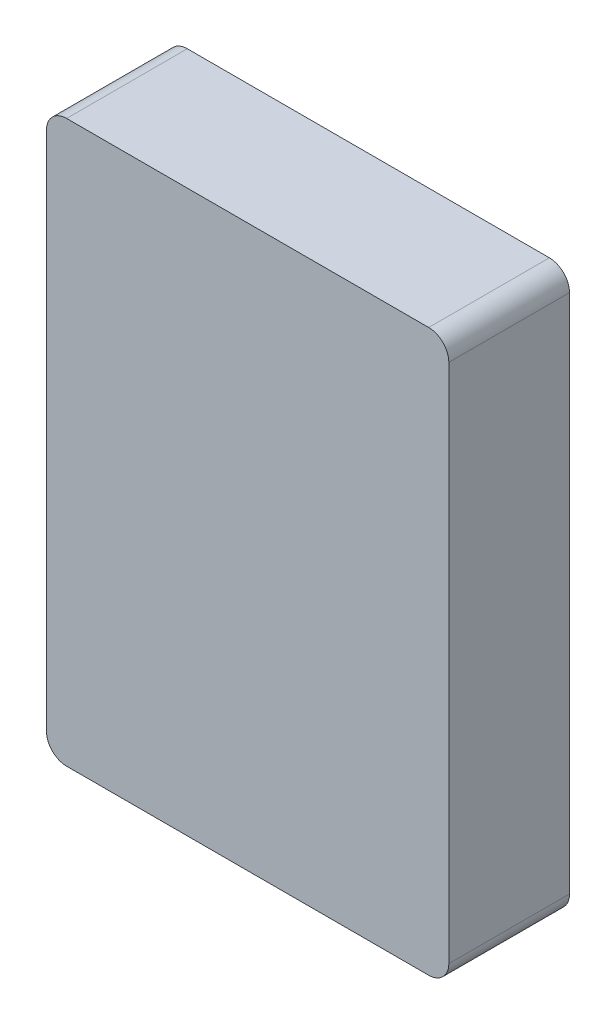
ISO-10303-21;
HEADER;
FILE_DESCRIPTION(('STEP AP214'),'2;1');
FILE_NAME('part.step','',(''),(''),'','','');
FILE_SCHEMA(('AUTOMOTIVE_DESIGN { 1 0 10303 214 1 1 1 1 }'));
ENDSEC;
DATA;
#1=APPLICATION_CONTEXT('core data for automotive mechanical design processes');
#2=APPLICATION_PROTOCOL_DEFINITION('international standard','automotive_design',2000,#1);
#3=PRODUCT_CONTEXT('',#1,'mechanical');
#4=PRODUCT('Part','Part','',(#3));
#5=PRODUCT_RELATED_PRODUCT_CATEGORY('part','',(#4));
#6=PRODUCT_DEFINITION_FORMATION('','',#4);
#7=PRODUCT_DEFINITION_CONTEXT('part definition',#1,'design');
#8=PRODUCT_DEFINITION('design','',#6,#7);
#9=PRODUCT_DEFINITION_SHAPE('','',#8);
#10=(LENGTH_UNIT() NAMED_UNIT(*) SI_UNIT(.MILLI.,.METRE.));
#11=(NAMED_UNIT(*) PLANE_ANGLE_UNIT() SI_UNIT($,.RADIAN.));
#12=(NAMED_UNIT(*) SI_UNIT($,.STERADIAN.) SOLID_ANGLE_UNIT());
#13=UNCERTAINTY_MEASURE_WITH_UNIT(LENGTH_MEASURE(1.E-05),#10,'distance_accuracy_value','');
#14=(GEOMETRIC_REPRESENTATION_CONTEXT(3) GLOBAL_UNCERTAINTY_ASSIGNED_CONTEXT((#13)) GLOBAL_UNIT_ASSIGNED_CONTEXT((#10,
#11,#12)) REPRESENTATION_CONTEXT('',''));
#15=CARTESIAN_POINT('',(0.,0.,0.));
#16=DIRECTION('',(0.,0.,1.));
#17=DIRECTION('',(1.,0.,0.));
#18=AXIS2_PLACEMENT_3D('',#15,#16,#17);
#19=CARTESIAN_POINT('',(0.,0.,60.));
#20=DIRECTION('',(1.,0.,0.));
#21=DIRECTION('',(0.,1.,0.));
#22=AXIS2_PLACEMENT_3D('',#19,#20,#21);
#23=PLANE('',#22);
#24=DIRECTION('',(0.,-1.,0.));
#25=VECTOR('',#24,1.);
#26=CARTESIAN_POINT('',(0.,0.,0.));
#27=LINE('',#26,#25);
#28=CARTESIAN_POINT('',(0.,-10.,0.));
#29=VERTEX_POINT('',#28);
#30=CARTESIAN_POINT('',(0.,-268.88,0.));
#31=VERTEX_POINT('',#30);
#32=EDGE_CURVE('E135',#29,#31,#27,.T.);
#33=ORIENTED_EDGE('',*,*,#32,.T.);
#34=DIRECTION('',(0.,0.,-1.));
#35=VECTOR('',#34,1.);
#36=CARTESIAN_POINT('',(0.,-268.88,60.));
#37=LINE('',#36,#35);
#38=CARTESIAN_POINT('',(0.,-268.88,60.));
#39=VERTEX_POINT('',#38);
#40=EDGE_CURVE('E110',#31,#39,#37,.F.);
#41=ORIENTED_EDGE('',*,*,#40,.T.);
#42=DIRECTION('',(0.,-1.,0.));
#43=VECTOR('',#42,1.);
#44=CARTESIAN_POINT('',(0.,0.,60.));
#45=LINE('',#44,#43);
#46=CARTESIAN_POINT('',(0.,-10.,60.));
#47=VERTEX_POINT('',#46);
#48=EDGE_CURVE('E147',#47,#39,#45,.T.);
#49=ORIENTED_EDGE('',*,*,#48,.F.);
#50=DIRECTION('',(0.,0.,-1.));
#51=VECTOR('',#50,1.);
#52=CARTESIAN_POINT('',(0.,-10.,60.));
#53=LINE('',#52,#51);
#54=EDGE_CURVE('E116',#47,#29,#53,.T.);
#55=ORIENTED_EDGE('',*,*,#54,.T.);
#56=EDGE_LOOP('',(#33,#41,#49,#55));
#57=FACE_BOUND('',#56,.T.);
#58=ADVANCED_FACE('F39',(#57),#23,.F.);
#59=CARTESIAN_POINT('',(0.,-278.88,60.));
#60=DIRECTION('',(0.,1.,0.));
#61=DIRECTION('',(0.,0.,1.));
#62=AXIS2_PLACEMENT_3D('',#59,#60,#61);
#63=PLANE('',#62);
#64=DIRECTION('',(1.,0.,0.));
#65=VECTOR('',#64,1.);
#66=CARTESIAN_POINT('',(0.,-278.88,60.));
#67=LINE('',#66,#65);
#68=CARTESIAN_POINT('',(10.,-278.88,60.));
#69=VERTEX_POINT('',#68);
#70=CARTESIAN_POINT('',(190.,-278.88,60.));
#71=VERTEX_POINT('',#70);
#72=EDGE_CURVE('E126',#69,#71,#67,.T.);
#73=ORIENTED_EDGE('',*,*,#72,.F.);
#74=DIRECTION('',(0.,0.,-1.));
#75=VECTOR('',#74,1.);
#76=CARTESIAN_POINT('',(10.,-278.88,60.));
#77=LINE('',#76,#75);
#78=CARTESIAN_POINT('',(10.,-278.88,0.));
#79=VERTEX_POINT('',#78);
#80=EDGE_CURVE('E109',#69,#79,#77,.T.);
#81=ORIENTED_EDGE('',*,*,#80,.T.);
#82=DIRECTION('',(1.,0.,0.));
#83=VECTOR('',#82,1.);
#84=CARTESIAN_POINT('',(0.,-278.88,0.));
#85=LINE('',#84,#83);
#86=CARTESIAN_POINT('',(190.,-278.88,0.));
#87=VERTEX_POINT('',#86);
#88=EDGE_CURVE('E123',#79,#87,#85,.T.);
#89=ORIENTED_EDGE('',*,*,#88,.T.);
#90=DIRECTION('',(0.,0.,-1.));
#91=VECTOR('',#90,1.);
#92=CARTESIAN_POINT('',(190.,-278.88,60.));
#93=LINE('',#92,#91);
#94=EDGE_CURVE('E129',#87,#71,#93,.F.);
#95=ORIENTED_EDGE('',*,*,#94,.T.);
#96=EDGE_LOOP('',(#73,#81,#89,#95));
#97=FACE_BOUND('',#96,.T.);
#98=ADVANCED_FACE('F122',(#97),#63,.F.);
#99=CARTESIAN_POINT('',(200.,0.,60.));
#100=DIRECTION('',(-1.,0.,0.));
#101=DIRECTION('',(0.,-1.,0.));
#102=AXIS2_PLACEMENT_3D('',#99,#100,#101);
#103=PLANE('',#102);
#104=DIRECTION('',(0.,1.,0.));
#105=VECTOR('',#104,1.);
#106=CARTESIAN_POINT('',(200.,0.,60.));
#107=LINE('',#106,#105);
#108=CARTESIAN_POINT('',(200.,-268.88,60.));
#109=VERTEX_POINT('',#108);
#110=CARTESIAN_POINT('',(200.,-10.,60.));
#111=VERTEX_POINT('',#110);
#112=EDGE_CURVE('E196',#109,#111,#107,.T.);
#113=ORIENTED_EDGE('',*,*,#112,.F.);
#114=DIRECTION('',(0.,0.,-1.));
#115=VECTOR('',#114,1.);
#116=CARTESIAN_POINT('',(200.,-268.88,60.));
#117=LINE('',#116,#115);
#118=CARTESIAN_POINT('',(200.,-268.88,0.));
#119=VERTEX_POINT('',#118);
#120=EDGE_CURVE('E177',#109,#119,#117,.T.);
#121=ORIENTED_EDGE('',*,*,#120,.T.);
#122=DIRECTION('',(0.,1.,0.));
#123=VECTOR('',#122,1.);
#124=CARTESIAN_POINT('',(200.,0.,0.));
#125=LINE('',#124,#123);
#126=CARTESIAN_POINT('',(200.,-10.,0.));
#127=VERTEX_POINT('',#126);
#128=EDGE_CURVE('E134',#119,#127,#125,.T.);
#129=ORIENTED_EDGE('',*,*,#128,.T.);
#130=DIRECTION('',(0.,0.,-1.));
#131=VECTOR('',#130,1.);
#132=CARTESIAN_POINT('',(200.,-10.,60.));
#133=LINE('',#132,#131);
#134=EDGE_CURVE('E174',#127,#111,#133,.F.);
#135=ORIENTED_EDGE('',*,*,#134,.T.);
#136=EDGE_LOOP('',(#113,#121,#129,#135));
#137=FACE_BOUND('',#136,.T.);
#138=ADVANCED_FACE('F209',(#137),#103,.F.);
#139=CARTESIAN_POINT('',(0.,0.,60.));
#140=DIRECTION('',(0.,-1.,0.));
#141=DIRECTION('',(0.,0.,-1.));
#142=AXIS2_PLACEMENT_3D('',#139,#140,#141);
#143=PLANE('',#142);
#144=DIRECTION('',(-1.,0.,0.));
#145=VECTOR('',#144,1.);
#146=CARTESIAN_POINT('',(0.,0.,0.));
#147=LINE('',#146,#145);
#148=CARTESIAN_POINT('',(190.,0.,0.));
#149=VERTEX_POINT('',#148);
#150=CARTESIAN_POINT('',(10.,0.,0.));
#151=VERTEX_POINT('',#150);
#152=EDGE_CURVE('E140',#149,#151,#147,.T.);
#153=ORIENTED_EDGE('',*,*,#152,.T.);
#154=DIRECTION('',(0.,0.,-1.));
#155=VECTOR('',#154,1.);
#156=CARTESIAN_POINT('',(10.,0.,60.));
#157=LINE('',#156,#155);
#158=CARTESIAN_POINT('',(10.,0.,60.));
#159=VERTEX_POINT('',#158);
#160=EDGE_CURVE('E11',#151,#159,#157,.F.);
#161=ORIENTED_EDGE('',*,*,#160,.T.);
#162=DIRECTION('',(-1.,0.,0.));
#163=VECTOR('',#162,1.);
#164=CARTESIAN_POINT('',(0.,0.,60.));
#165=LINE('',#164,#163);
#166=CARTESIAN_POINT('',(190.,0.,60.));
#167=VERTEX_POINT('',#166);
#168=EDGE_CURVE('E149',#167,#159,#165,.T.);
#169=ORIENTED_EDGE('',*,*,#168,.F.);
#170=DIRECTION('',(0.,0.,-1.));
#171=VECTOR('',#170,1.);
#172=CARTESIAN_POINT('',(190.,0.,60.));
#173=LINE('',#172,#171);
#174=EDGE_CURVE('E48',#167,#149,#173,.T.);
#175=ORIENTED_EDGE('',*,*,#174,.T.);
#176=EDGE_LOOP('',(#153,#161,#169,#175));
#177=FACE_BOUND('',#176,.T.);
#178=ADVANCED_FACE('F184',(#177),#143,.F.);
#179=CARTESIAN_POINT('',(0.,0.,60.));
#180=DIRECTION('',(0.,0.,1.));
#181=DIRECTION('',(1.,0.,0.));
#182=AXIS2_PLACEMENT_3D('',#179,#180,#181);
#183=PLANE('',#182);
#184=ORIENTED_EDGE('',*,*,#48,.T.);
#185=CARTESIAN_POINT('',(10.,-268.88,60.));
#186=DIRECTION('',(0.,0.,1.));
#187=DIRECTION('',(1.,0.,0.));
#188=AXIS2_PLACEMENT_3D('',#185,#186,#187);
#189=CIRCLE('',#188,10.);
#190=EDGE_CURVE('E171',#39,#69,#189,.T.);
#191=ORIENTED_EDGE('',*,*,#190,.T.);
#192=ORIENTED_EDGE('',*,*,#72,.T.);
#193=CARTESIAN_POINT('',(190.,-268.88,60.));
#194=DIRECTION('',(0.,0.,1.));
#195=DIRECTION('',(1.,0.,0.));
#196=AXIS2_PLACEMENT_3D('',#193,#194,#195);
#197=CIRCLE('',#196,10.);
#198=EDGE_CURVE('E168',#71,#109,#197,.T.);
#199=ORIENTED_EDGE('',*,*,#198,.T.);
#200=ORIENTED_EDGE('',*,*,#112,.T.);
#201=CARTESIAN_POINT('',(190.,-10.,60.));
#202=DIRECTION('',(0.,0.,1.));
#203=DIRECTION('',(1.,0.,0.));
#204=AXIS2_PLACEMENT_3D('',#201,#202,#203);
#205=CIRCLE('',#204,10.);
#206=EDGE_CURVE('E60',#111,#167,#205,.T.);
#207=ORIENTED_EDGE('',*,*,#206,.T.);
#208=ORIENTED_EDGE('',*,*,#168,.T.);
#209=CARTESIAN_POINT('',(10.,-10.,60.));
#210=DIRECTION('',(0.,0.,1.));
#211=DIRECTION('',(1.,0.,0.));
#212=AXIS2_PLACEMENT_3D('',#209,#210,#211);
#213=CIRCLE('',#212,10.);
#214=EDGE_CURVE('E165',#159,#47,#213,.T.);
#215=ORIENTED_EDGE('',*,*,#214,.T.);
#216=EDGE_LOOP('',(#184,#191,#192,#199,#200,#207,#208,#215));
#217=FACE_BOUND('',#216,.T.);
#218=ADVANCED_FACE('F201',(#217),#183,.T.);
#219=CARTESIAN_POINT('',(0.,0.,0.));
#220=DIRECTION('',(0.,0.,1.));
#221=DIRECTION('',(1.,0.,0.));
#222=AXIS2_PLACEMENT_3D('',#219,#220,#221);
#223=PLANE('',#222);
#224=ORIENTED_EDGE('',*,*,#88,.F.);
#225=CARTESIAN_POINT('',(10.,-268.88,0.));
#226=DIRECTION('',(0.,0.,1.));
#227=DIRECTION('',(1.,0.,0.));
#228=AXIS2_PLACEMENT_3D('',#225,#226,#227);
#229=CIRCLE('',#228,10.);
#230=EDGE_CURVE('E105',#79,#31,#229,.F.);
#231=ORIENTED_EDGE('',*,*,#230,.T.);
#232=ORIENTED_EDGE('',*,*,#32,.F.);
#233=CARTESIAN_POINT('',(10.,-10.,0.));
#234=DIRECTION('',(0.,0.,1.));
#235=DIRECTION('',(1.,0.,0.));
#236=AXIS2_PLACEMENT_3D('',#233,#234,#235);
#237=CIRCLE('',#236,10.);
#238=EDGE_CURVE('E153',#29,#151,#237,.F.);
#239=ORIENTED_EDGE('',*,*,#238,.T.);
#240=ORIENTED_EDGE('',*,*,#152,.F.);
#241=CARTESIAN_POINT('',(190.,-10.,0.));
#242=DIRECTION('',(0.,0.,1.));
#243=DIRECTION('',(1.,0.,0.));
#244=AXIS2_PLACEMENT_3D('',#241,#242,#243);
#245=CIRCLE('',#244,10.);
#246=EDGE_CURVE('E128',#149,#127,#245,.F.);
#247=ORIENTED_EDGE('',*,*,#246,.T.);
#248=ORIENTED_EDGE('',*,*,#128,.F.);
#249=CARTESIAN_POINT('',(190.,-268.88,0.));
#250=DIRECTION('',(0.,0.,1.));
#251=DIRECTION('',(1.,0.,0.));
#252=AXIS2_PLACEMENT_3D('',#249,#250,#251);
#253=CIRCLE('',#252,10.);
#254=EDGE_CURVE('E117',#119,#87,#253,.F.);
#255=ORIENTED_EDGE('',*,*,#254,.T.);
#256=EDGE_LOOP('',(#224,#231,#232,#239,#240,#247,#248,#255));
#257=FACE_BOUND('',#256,.T.);
#258=ADVANCED_FACE('F131',(#257),#223,.F.);
#259=CARTESIAN_POINT('',(10.,-268.88,60.));
#260=DIRECTION('',(0.,0.,-1.));
#261=DIRECTION('',(-1.,0.,0.));
#262=AXIS2_PLACEMENT_3D('',#259,#260,#261);
#263=CYLINDRICAL_SURFACE('',#262,10.);
#264=ORIENTED_EDGE('',*,*,#190,.F.);
#265=ORIENTED_EDGE('',*,*,#40,.F.);
#266=ORIENTED_EDGE('',*,*,#230,.F.);
#267=ORIENTED_EDGE('',*,*,#80,.F.);
#268=EDGE_LOOP('',(#264,#265,#266,#267));
#269=FACE_BOUND('',#268,.T.);
#270=ADVANCED_FACE('F108',(#269),#263,.T.);
#271=CARTESIAN_POINT('',(190.,-268.88,60.));
#272=DIRECTION('',(0.,0.,-1.));
#273=DIRECTION('',(-1.,0.,0.));
#274=AXIS2_PLACEMENT_3D('',#271,#272,#273);
#275=CYLINDRICAL_SURFACE('',#274,10.);
#276=ORIENTED_EDGE('',*,*,#198,.F.);
#277=ORIENTED_EDGE('',*,*,#94,.F.);
#278=ORIENTED_EDGE('',*,*,#254,.F.);
#279=ORIENTED_EDGE('',*,*,#120,.F.);
#280=EDGE_LOOP('',(#276,#277,#278,#279));
#281=FACE_BOUND('',#280,.T.);
#282=ADVANCED_FACE('F221',(#281),#275,.T.);
#283=CARTESIAN_POINT('',(10.,-10.,60.));
#284=DIRECTION('',(0.,0.,-1.));
#285=DIRECTION('',(-1.,0.,0.));
#286=AXIS2_PLACEMENT_3D('',#283,#284,#285);
#287=CYLINDRICAL_SURFACE('',#286,10.);
#288=ORIENTED_EDGE('',*,*,#214,.F.);
#289=ORIENTED_EDGE('',*,*,#160,.F.);
#290=ORIENTED_EDGE('',*,*,#238,.F.);
#291=ORIENTED_EDGE('',*,*,#54,.F.);
#292=EDGE_LOOP('',(#288,#289,#290,#291));
#293=FACE_BOUND('',#292,.T.);
#294=ADVANCED_FACE('F189',(#293),#287,.T.);
#295=CARTESIAN_POINT('',(190.,-10.,60.));
#296=DIRECTION('',(0.,0.,-1.));
#297=DIRECTION('',(-1.,0.,0.));
#298=AXIS2_PLACEMENT_3D('',#295,#296,#297);
#299=CYLINDRICAL_SURFACE('',#298,10.);
#300=ORIENTED_EDGE('',*,*,#206,.F.);
#301=ORIENTED_EDGE('',*,*,#134,.F.);
#302=ORIENTED_EDGE('',*,*,#246,.F.);
#303=ORIENTED_EDGE('',*,*,#174,.F.);
#304=EDGE_LOOP('',(#300,#301,#302,#303));
#305=FACE_BOUND('',#304,.T.);
#306=ADVANCED_FACE('F41',(#305),#299,.T.);
#307=CLOSED_SHELL('',(#58,#98,#138,#178,#218,#258,#270,#282,#294,#306));
#308=MANIFOLD_SOLID_BREP('B2',#307);
#309=ADVANCED_BREP_SHAPE_REPRESENTATION('',(#18,#308),#14);
#310=SHAPE_DEFINITION_REPRESENTATION(#9,#309);
ENDSEC;
END-ISO-10303-21;
